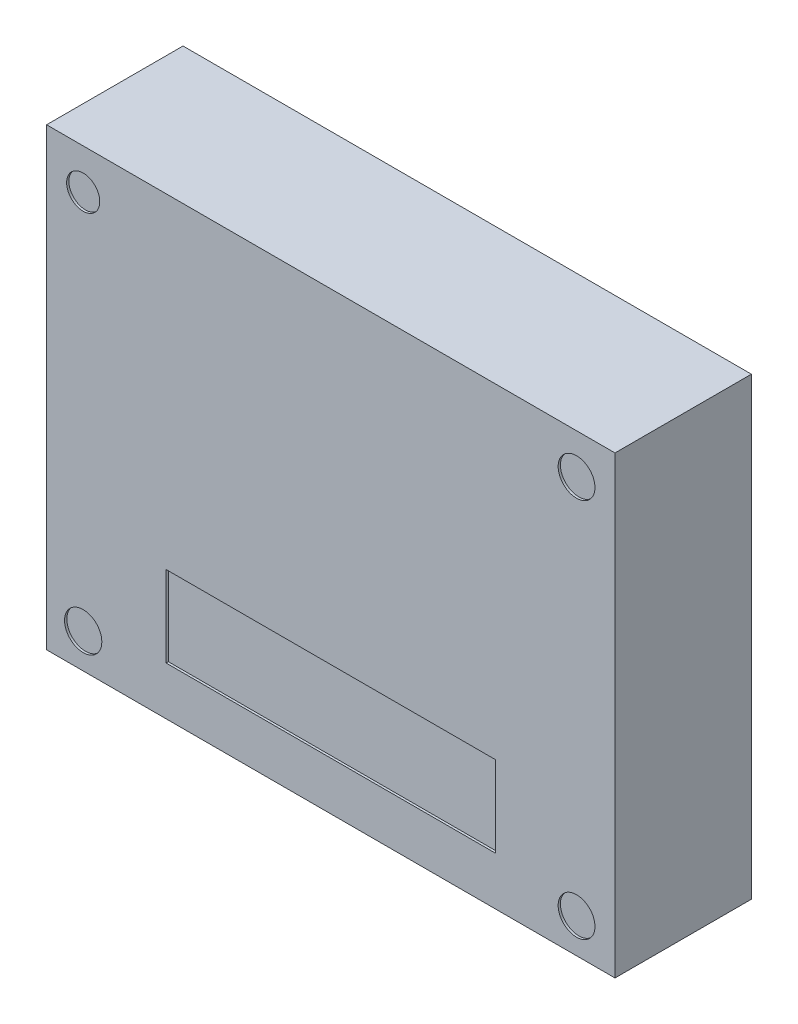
ISO-10303-21;
HEADER;
FILE_DESCRIPTION(('STEP AP214'),'2;1');
FILE_NAME('part.step','',(''),(''),'','','');
FILE_SCHEMA(('AUTOMOTIVE_DESIGN { 1 0 10303 214 1 1 1 1 }'));
ENDSEC;
DATA;
#1=APPLICATION_CONTEXT('core data for automotive mechanical design processes');
#2=APPLICATION_PROTOCOL_DEFINITION('international standard','automotive_design',2000,#1);
#3=PRODUCT_CONTEXT('',#1,'mechanical');
#4=PRODUCT('Part','Part','',(#3));
#5=PRODUCT_RELATED_PRODUCT_CATEGORY('part','',(#4));
#6=PRODUCT_DEFINITION_FORMATION('','',#4);
#7=PRODUCT_DEFINITION_CONTEXT('part definition',#1,'design');
#8=PRODUCT_DEFINITION('design','',#6,#7);
#9=PRODUCT_DEFINITION_SHAPE('','',#8);
#10=(LENGTH_UNIT() NAMED_UNIT(*) SI_UNIT(.MILLI.,.METRE.));
#11=(NAMED_UNIT(*) PLANE_ANGLE_UNIT() SI_UNIT($,.RADIAN.));
#12=(NAMED_UNIT(*) SI_UNIT($,.STERADIAN.) SOLID_ANGLE_UNIT());
#13=UNCERTAINTY_MEASURE_WITH_UNIT(LENGTH_MEASURE(1.E-05),#10,'distance_accuracy_value','');
#14=(GEOMETRIC_REPRESENTATION_CONTEXT(3) GLOBAL_UNCERTAINTY_ASSIGNED_CONTEXT((#13)) GLOBAL_UNIT_ASSIGNED_CONTEXT((#10,
#11,#12)) REPRESENTATION_CONTEXT('',''));
#15=CARTESIAN_POINT('',(0.,0.,0.));
#16=DIRECTION('',(0.,0.,1.));
#17=DIRECTION('',(1.,0.,0.));
#18=AXIS2_PLACEMENT_3D('',#15,#16,#17);
#19=CARTESIAN_POINT('',(-125.,200.,30.));
#20=DIRECTION('',(1.,0.,0.));
#21=DIRECTION('',(0.,0.,-1.));
#22=AXIS2_PLACEMENT_3D('',#19,#20,#21);
#23=PLANE('',#22);
#24=DIRECTION('',(0.,0.,1.));
#25=VECTOR('',#24,1.);
#26=CARTESIAN_POINT('',(-125.,0.,30.));
#27=LINE('',#26,#25);
#28=CARTESIAN_POINT('',(-125.,0.,-30.));
#29=VERTEX_POINT('',#28);
#30=CARTESIAN_POINT('',(-125.,0.,30.));
#31=VERTEX_POINT('',#30);
#32=EDGE_CURVE('E145',#29,#31,#27,.T.);
#33=ORIENTED_EDGE('',*,*,#32,.T.);
#34=DIRECTION('',(0.,-1.,0.));
#35=VECTOR('',#34,1.);
#36=CARTESIAN_POINT('',(-125.,200.,30.));
#37=LINE('',#36,#35);
#38=CARTESIAN_POINT('',(-125.,200.,30.));
#39=VERTEX_POINT('',#38);
#40=EDGE_CURVE('E11',#39,#31,#37,.T.);
#41=ORIENTED_EDGE('',*,*,#40,.F.);
#42=DIRECTION('',(0.,0.,1.));
#43=VECTOR('',#42,1.);
#44=CARTESIAN_POINT('',(-125.,200.,30.));
#45=LINE('',#44,#43);
#46=CARTESIAN_POINT('',(-125.,200.,-30.));
#47=VERTEX_POINT('',#46);
#48=EDGE_CURVE('E149',#47,#39,#45,.T.);
#49=ORIENTED_EDGE('',*,*,#48,.F.);
#50=DIRECTION('',(0.,-1.,0.));
#51=VECTOR('',#50,1.);
#52=CARTESIAN_POINT('',(-125.,200.,-30.));
#53=LINE('',#52,#51);
#54=EDGE_CURVE('E155',#47,#29,#53,.T.);
#55=ORIENTED_EDGE('',*,*,#54,.T.);
#56=EDGE_LOOP('',(#33,#41,#49,#55));
#57=FACE_BOUND('',#56,.T.);
#58=ADVANCED_FACE('F33',(#57),#23,.F.);
#59=CARTESIAN_POINT('',(125.,200.,30.));
#60=DIRECTION('',(0.,0.,-1.));
#61=DIRECTION('',(-1.,0.,0.));
#62=AXIS2_PLACEMENT_3D('',#59,#60,#61);
#63=PLANE('',#62);
#64=CARTESIAN_POINT('',(108.09503550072,182.387040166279,30.));
#65=DIRECTION('',(0.,0.,1.));
#66=DIRECTION('',(1.,0.,0.));
#67=AXIS2_PLACEMENT_3D('',#64,#65,#66);
#68=CIRCLE('',#67,8.09700640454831);
#69=CARTESIAN_POINT('',(116.192041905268,182.387040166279,30.));
#70=VERTEX_POINT('',#69);
#71=EDGE_CURVE('E199',#70,#70,#68,.T.);
#72=ORIENTED_EDGE('',*,*,#71,.F.);
#73=EDGE_LOOP('',(#72));
#74=FACE_BOUND('',#73,.T.);
#75=CARTESIAN_POINT('',(108.09503550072,15.1838579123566,30.));
#76=DIRECTION('',(0.,0.,1.));
#77=DIRECTION('',(1.,0.,0.));
#78=AXIS2_PLACEMENT_3D('',#75,#76,#77);
#79=CIRCLE('',#78,8.09700640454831);
#80=CARTESIAN_POINT('',(116.192041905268,15.1838579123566,30.));
#81=VERTEX_POINT('',#80);
#82=EDGE_CURVE('E203',#81,#81,#79,.T.);
#83=ORIENTED_EDGE('',*,*,#82,.F.);
#84=EDGE_LOOP('',(#83));
#85=FACE_BOUND('',#84,.T.);
#86=CARTESIAN_POINT('',(-108.904736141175,15.1838579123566,30.));
#87=DIRECTION('',(0.,0.,1.));
#88=DIRECTION('',(1.,0.,0.));
#89=AXIS2_PLACEMENT_3D('',#86,#87,#88);
#90=CIRCLE('',#89,8.19759419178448);
#91=CARTESIAN_POINT('',(-100.70714194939,15.1838579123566,30.));
#92=VERTEX_POINT('',#91);
#93=EDGE_CURVE('E207',#92,#92,#90,.T.);
#94=ORIENTED_EDGE('',*,*,#93,.F.);
#95=EDGE_LOOP('',(#94));
#96=FACE_BOUND('',#95,.T.);
#97=CARTESIAN_POINT('',(-108.904736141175,182.387040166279,30.));
#98=DIRECTION('',(0.,0.,1.));
#99=DIRECTION('',(1.,0.,0.));
#100=AXIS2_PLACEMENT_3D('',#97,#98,#99);
#101=CIRCLE('',#100,7.28730576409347);
#102=CARTESIAN_POINT('',(-101.617430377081,182.387040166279,30.));
#103=VERTEX_POINT('',#102);
#104=EDGE_CURVE('E132',#103,#103,#101,.T.);
#105=ORIENTED_EDGE('',*,*,#104,.F.);
#106=EDGE_LOOP('',(#105));
#107=FACE_BOUND('',#106,.T.);
#108=DIRECTION('',(-1.,0.,0.));
#109=VECTOR('',#108,1.);
#110=CARTESIAN_POINT('',(-72.4682073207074,56.8834408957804,30.));
#111=LINE('',#110,#109);
#112=CARTESIAN_POINT('',(72.4682073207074,56.8834408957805,30.));
#113=VERTEX_POINT('',#112);
#114=CARTESIAN_POINT('',(-72.4682073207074,56.8834408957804,30.));
#115=VERTEX_POINT('',#114);
#116=EDGE_CURVE('E138',#113,#115,#111,.T.);
#117=ORIENTED_EDGE('',*,*,#116,.F.);
#118=DIRECTION('',(0.,1.,0.));
#119=VECTOR('',#118,1.);
#120=CARTESIAN_POINT('',(72.4682073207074,56.8834408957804,30.));
#121=LINE('',#120,#119);
#122=CARTESIAN_POINT('',(72.4682073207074,21.2566127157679,30.));
#123=VERTEX_POINT('',#122);
#124=EDGE_CURVE('E47',#123,#113,#121,.T.);
#125=ORIENTED_EDGE('',*,*,#124,.F.);
#126=DIRECTION('',(1.,0.,0.));
#127=VECTOR('',#126,1.);
#128=CARTESIAN_POINT('',(-72.4682073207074,21.2566127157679,30.));
#129=LINE('',#128,#127);
#130=CARTESIAN_POINT('',(-72.4682073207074,21.2566127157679,30.));
#131=VERTEX_POINT('',#130);
#132=EDGE_CURVE('E126',#131,#123,#129,.T.);
#133=ORIENTED_EDGE('',*,*,#132,.F.);
#134=DIRECTION('',(0.,-1.,0.));
#135=VECTOR('',#134,1.);
#136=CARTESIAN_POINT('',(-72.4682073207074,56.8834408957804,30.));
#137=LINE('',#136,#135);
#138=EDGE_CURVE('E129',#115,#131,#137,.T.);
#139=ORIENTED_EDGE('',*,*,#138,.F.);
#140=EDGE_LOOP('',(#117,#125,#133,#139));
#141=FACE_BOUND('',#140,.T.);
#142=DIRECTION('',(1.,0.,0.));
#143=VECTOR('',#142,1.);
#144=CARTESIAN_POINT('',(125.,0.,30.));
#145=LINE('',#144,#143);
#146=CARTESIAN_POINT('',(125.,0.,30.));
#147=VERTEX_POINT('',#146);
#148=EDGE_CURVE('E158',#31,#147,#145,.T.);
#149=ORIENTED_EDGE('',*,*,#148,.T.);
#150=DIRECTION('',(0.,-1.,0.));
#151=VECTOR('',#150,1.);
#152=CARTESIAN_POINT('',(125.,200.,30.));
#153=LINE('',#152,#151);
#154=CARTESIAN_POINT('',(125.,200.,30.));
#155=VERTEX_POINT('',#154);
#156=EDGE_CURVE('E40',#155,#147,#153,.T.);
#157=ORIENTED_EDGE('',*,*,#156,.F.);
#158=DIRECTION('',(1.,0.,0.));
#159=VECTOR('',#158,1.);
#160=CARTESIAN_POINT('',(125.,200.,30.));
#161=LINE('',#160,#159);
#162=EDGE_CURVE('E84',#39,#155,#161,.T.);
#163=ORIENTED_EDGE('',*,*,#162,.F.);
#164=ORIENTED_EDGE('',*,*,#40,.T.);
#165=EDGE_LOOP('',(#149,#157,#163,#164));
#166=FACE_BOUND('',#165,.T.);
#167=ADVANCED_FACE('F186',(#74,#85,#96,#107,#141,#166),#63,.F.);
#168=CARTESIAN_POINT('',(125.,200.,30.));
#169=DIRECTION('',(-1.,0.,0.));
#170=DIRECTION('',(0.,0.,1.));
#171=AXIS2_PLACEMENT_3D('',#168,#169,#170);
#172=PLANE('',#171);
#173=DIRECTION('',(0.,0.,-1.));
#174=VECTOR('',#173,1.);
#175=CARTESIAN_POINT('',(125.,0.,30.));
#176=LINE('',#175,#174);
#177=CARTESIAN_POINT('',(125.,0.,-30.));
#178=VERTEX_POINT('',#177);
#179=EDGE_CURVE('E160',#147,#178,#176,.T.);
#180=ORIENTED_EDGE('',*,*,#179,.T.);
#181=DIRECTION('',(0.,-1.,0.));
#182=VECTOR('',#181,1.);
#183=CARTESIAN_POINT('',(125.,200.,-30.));
#184=LINE('',#183,#182);
#185=CARTESIAN_POINT('',(125.,200.,-30.));
#186=VERTEX_POINT('',#185);
#187=EDGE_CURVE('E164',#186,#178,#184,.T.);
#188=ORIENTED_EDGE('',*,*,#187,.F.);
#189=DIRECTION('',(0.,0.,-1.));
#190=VECTOR('',#189,1.);
#191=CARTESIAN_POINT('',(125.,200.,30.));
#192=LINE('',#191,#190);
#193=EDGE_CURVE('E152',#155,#186,#192,.T.);
#194=ORIENTED_EDGE('',*,*,#193,.F.);
#195=ORIENTED_EDGE('',*,*,#156,.T.);
#196=EDGE_LOOP('',(#180,#188,#194,#195));
#197=FACE_BOUND('',#196,.T.);
#198=ADVANCED_FACE('F169',(#197),#172,.F.);
#199=CARTESIAN_POINT('',(125.,200.,-30.));
#200=DIRECTION('',(0.,0.,1.));
#201=DIRECTION('',(1.,0.,0.));
#202=AXIS2_PLACEMENT_3D('',#199,#200,#201);
#203=PLANE('',#202);
#204=DIRECTION('',(-1.,0.,0.));
#205=VECTOR('',#204,1.);
#206=CARTESIAN_POINT('',(125.,0.,-30.));
#207=LINE('',#206,#205);
#208=EDGE_CURVE('E77',#178,#29,#207,.T.);
#209=ORIENTED_EDGE('',*,*,#208,.T.);
#210=ORIENTED_EDGE('',*,*,#54,.F.);
#211=DIRECTION('',(-1.,0.,0.));
#212=VECTOR('',#211,1.);
#213=CARTESIAN_POINT('',(125.,200.,-30.));
#214=LINE('',#213,#212);
#215=EDGE_CURVE('E56',#186,#47,#214,.T.);
#216=ORIENTED_EDGE('',*,*,#215,.F.);
#217=ORIENTED_EDGE('',*,*,#187,.T.);
#218=EDGE_LOOP('',(#209,#210,#216,#217));
#219=FACE_BOUND('',#218,.T.);
#220=ADVANCED_FACE('F177',(#219),#203,.F.);
#221=CARTESIAN_POINT('',(0.,200.,0.));
#222=DIRECTION('',(0.,1.,0.));
#223=DIRECTION('',(0.,0.,1.));
#224=AXIS2_PLACEMENT_3D('',#221,#222,#223);
#225=PLANE('',#224);
#226=ORIENTED_EDGE('',*,*,#48,.T.);
#227=ORIENTED_EDGE('',*,*,#162,.T.);
#228=ORIENTED_EDGE('',*,*,#193,.T.);
#229=ORIENTED_EDGE('',*,*,#215,.T.);
#230=EDGE_LOOP('',(#226,#227,#228,#229));
#231=FACE_BOUND('',#230,.T.);
#232=ADVANCED_FACE('F179',(#231),#225,.T.);
#233=CARTESIAN_POINT('',(0.,0.,0.));
#234=DIRECTION('',(0.,1.,0.));
#235=DIRECTION('',(0.,0.,1.));
#236=AXIS2_PLACEMENT_3D('',#233,#234,#235);
#237=PLANE('',#236);
#238=ORIENTED_EDGE('',*,*,#32,.F.);
#239=ORIENTED_EDGE('',*,*,#208,.F.);
#240=ORIENTED_EDGE('',*,*,#179,.F.);
#241=ORIENTED_EDGE('',*,*,#148,.F.);
#242=EDGE_LOOP('',(#238,#239,#240,#241));
#243=FACE_BOUND('',#242,.T.);
#244=ADVANCED_FACE('F173',(#243),#237,.F.);
#245=CARTESIAN_POINT('',(72.4682073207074,56.8834408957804,29.));
#246=DIRECTION('',(1.,0.,0.));
#247=DIRECTION('',(0.,0.,-1.));
#248=AXIS2_PLACEMENT_3D('',#245,#246,#247);
#249=PLANE('',#248);
#250=ORIENTED_EDGE('',*,*,#124,.T.);
#251=DIRECTION('',(0.,0.,1.));
#252=VECTOR('',#251,1.);
#253=CARTESIAN_POINT('',(72.4682073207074,56.8834408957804,29.));
#254=LINE('',#253,#252);
#255=CARTESIAN_POINT('',(72.4682073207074,56.8834408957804,29.));
#256=VERTEX_POINT('',#255);
#257=EDGE_CURVE('E104',#256,#113,#254,.T.);
#258=ORIENTED_EDGE('',*,*,#257,.F.);
#259=DIRECTION('',(0.,1.,0.));
#260=VECTOR('',#259,1.);
#261=CARTESIAN_POINT('',(72.4682073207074,56.8834408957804,29.));
#262=LINE('',#261,#260);
#263=CARTESIAN_POINT('',(72.4682073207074,21.2566127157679,29.));
#264=VERTEX_POINT('',#263);
#265=EDGE_CURVE('E108',#264,#256,#262,.T.);
#266=ORIENTED_EDGE('',*,*,#265,.F.);
#267=DIRECTION('',(0.,0.,1.));
#268=VECTOR('',#267,1.);
#269=CARTESIAN_POINT('',(72.4682073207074,21.2566127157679,29.));
#270=LINE('',#269,#268);
#271=EDGE_CURVE('E143',#264,#123,#270,.T.);
#272=ORIENTED_EDGE('',*,*,#271,.T.);
#273=EDGE_LOOP('',(#250,#258,#266,#272));
#274=FACE_BOUND('',#273,.T.);
#275=ADVANCED_FACE('F106',(#274),#249,.F.);
#276=CARTESIAN_POINT('',(-72.4682073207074,21.2566127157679,29.));
#277=DIRECTION('',(0.,-1.,0.));
#278=DIRECTION('',(0.,0.,-1.));
#279=AXIS2_PLACEMENT_3D('',#276,#277,#278);
#280=PLANE('',#279);
#281=ORIENTED_EDGE('',*,*,#132,.T.);
#282=ORIENTED_EDGE('',*,*,#271,.F.);
#283=DIRECTION('',(1.,0.,0.));
#284=VECTOR('',#283,1.);
#285=CARTESIAN_POINT('',(-72.4682073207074,21.2566127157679,29.));
#286=LINE('',#285,#284);
#287=CARTESIAN_POINT('',(-72.4682073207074,21.2566127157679,29.));
#288=VERTEX_POINT('',#287);
#289=EDGE_CURVE('E114',#288,#264,#286,.T.);
#290=ORIENTED_EDGE('',*,*,#289,.F.);
#291=DIRECTION('',(0.,0.,1.));
#292=VECTOR('',#291,1.);
#293=CARTESIAN_POINT('',(-72.4682073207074,21.2566127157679,29.));
#294=LINE('',#293,#292);
#295=EDGE_CURVE('E146',#288,#131,#294,.T.);
#296=ORIENTED_EDGE('',*,*,#295,.T.);
#297=EDGE_LOOP('',(#281,#282,#290,#296));
#298=FACE_BOUND('',#297,.T.);
#299=ADVANCED_FACE('F216',(#298),#280,.F.);
#300=CARTESIAN_POINT('',(-72.4682073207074,56.8834408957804,29.));
#301=DIRECTION('',(-1.,0.,0.));
#302=DIRECTION('',(0.,0.,1.));
#303=AXIS2_PLACEMENT_3D('',#300,#301,#302);
#304=PLANE('',#303);
#305=ORIENTED_EDGE('',*,*,#138,.T.);
#306=ORIENTED_EDGE('',*,*,#295,.F.);
#307=DIRECTION('',(0.,-1.,0.));
#308=VECTOR('',#307,1.);
#309=CARTESIAN_POINT('',(-72.4682073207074,56.8834408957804,29.));
#310=LINE('',#309,#308);
#311=CARTESIAN_POINT('',(-72.4682073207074,56.8834408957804,29.));
#312=VERTEX_POINT('',#311);
#313=EDGE_CURVE('E122',#312,#288,#310,.T.);
#314=ORIENTED_EDGE('',*,*,#313,.F.);
#315=DIRECTION('',(0.,0.,1.));
#316=VECTOR('',#315,1.);
#317=CARTESIAN_POINT('',(-72.4682073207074,56.8834408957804,29.));
#318=LINE('',#317,#316);
#319=EDGE_CURVE('E113',#312,#115,#318,.T.);
#320=ORIENTED_EDGE('',*,*,#319,.T.);
#321=EDGE_LOOP('',(#305,#306,#314,#320));
#322=FACE_BOUND('',#321,.T.);
#323=ADVANCED_FACE('F214',(#322),#304,.F.);
#324=CARTESIAN_POINT('',(-72.4682073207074,56.8834408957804,29.));
#325=DIRECTION('',(0.,1.,0.));
#326=DIRECTION('',(0.,0.,1.));
#327=AXIS2_PLACEMENT_3D('',#324,#325,#326);
#328=PLANE('',#327);
#329=ORIENTED_EDGE('',*,*,#116,.T.);
#330=ORIENTED_EDGE('',*,*,#319,.F.);
#331=DIRECTION('',(-1.,0.,0.));
#332=VECTOR('',#331,1.);
#333=CARTESIAN_POINT('',(-72.4682073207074,56.8834408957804,29.));
#334=LINE('',#333,#332);
#335=EDGE_CURVE('E117',#256,#312,#334,.T.);
#336=ORIENTED_EDGE('',*,*,#335,.F.);
#337=ORIENTED_EDGE('',*,*,#257,.T.);
#338=EDGE_LOOP('',(#329,#330,#336,#337));
#339=FACE_BOUND('',#338,.T.);
#340=ADVANCED_FACE('F118',(#339),#328,.F.);
#341=CARTESIAN_POINT('',(0.,0.,29.));
#342=DIRECTION('',(0.,0.,1.));
#343=DIRECTION('',(1.,0.,0.));
#344=AXIS2_PLACEMENT_3D('',#341,#342,#343);
#345=PLANE('',#344);
#346=ORIENTED_EDGE('',*,*,#265,.T.);
#347=ORIENTED_EDGE('',*,*,#335,.T.);
#348=ORIENTED_EDGE('',*,*,#313,.T.);
#349=ORIENTED_EDGE('',*,*,#289,.T.);
#350=EDGE_LOOP('',(#346,#347,#348,#349));
#351=FACE_BOUND('',#350,.T.);
#352=ADVANCED_FACE('F124',(#351),#345,.T.);
#353=CARTESIAN_POINT('',(-108.904736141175,182.387040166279,29.));
#354=DIRECTION('',(0.,0.,1.));
#355=DIRECTION('',(1.,0.,0.));
#356=AXIS2_PLACEMENT_3D('',#353,#354,#355);
#357=CYLINDRICAL_SURFACE('',#356,7.28730576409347);
#358=CARTESIAN_POINT('',(-108.904736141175,182.387040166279,29.));
#359=DIRECTION('',(0.,0.,1.));
#360=DIRECTION('',(1.,0.,0.));
#361=AXIS2_PLACEMENT_3D('',#358,#359,#360);
#362=CIRCLE('',#361,7.28730576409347);
#363=CARTESIAN_POINT('',(-101.617430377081,182.387040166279,29.));
#364=VERTEX_POINT('',#363);
#365=EDGE_CURVE('E139',#364,#364,#362,.T.);
#366=ORIENTED_EDGE('',*,*,#365,.F.);
#367=EDGE_LOOP('',(#366));
#368=FACE_BOUND('',#367,.T.);
#369=ORIENTED_EDGE('',*,*,#104,.T.);
#370=EDGE_LOOP('',(#369));
#371=FACE_BOUND('',#370,.T.);
#372=ADVANCED_FACE('F262',(#368,#371),#357,.F.);
#373=CARTESIAN_POINT('',(-108.904736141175,182.387040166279,29.));
#374=DIRECTION('',(0.,0.,1.));
#375=DIRECTION('',(1.,0.,0.));
#376=AXIS2_PLACEMENT_3D('',#373,#374,#375);
#377=PLANE('',#376);
#378=ORIENTED_EDGE('',*,*,#365,.T.);
#379=EDGE_LOOP('',(#378));
#380=FACE_BOUND('',#379,.T.);
#381=ADVANCED_FACE('F277',(#380),#377,.T.);
#382=CARTESIAN_POINT('',(-108.904736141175,15.1838579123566,29.));
#383=DIRECTION('',(0.,0.,1.));
#384=DIRECTION('',(1.,0.,0.));
#385=AXIS2_PLACEMENT_3D('',#382,#383,#384);
#386=CYLINDRICAL_SURFACE('',#385,8.19759419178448);
#387=CARTESIAN_POINT('',(-108.904736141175,15.1838579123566,29.));
#388=DIRECTION('',(0.,0.,1.));
#389=DIRECTION('',(1.,0.,0.));
#390=AXIS2_PLACEMENT_3D('',#387,#388,#389);
#391=CIRCLE('',#390,8.19759419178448);
#392=CARTESIAN_POINT('',(-100.70714194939,15.1838579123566,29.));
#393=VERTEX_POINT('',#392);
#394=EDGE_CURVE('E360',#393,#393,#391,.T.);
#395=ORIENTED_EDGE('',*,*,#394,.F.);
#396=EDGE_LOOP('',(#395));
#397=FACE_BOUND('',#396,.T.);
#398=ORIENTED_EDGE('',*,*,#93,.T.);
#399=EDGE_LOOP('',(#398));
#400=FACE_BOUND('',#399,.T.);
#401=ADVANCED_FACE('F286',(#397,#400),#386,.F.);
#402=CARTESIAN_POINT('',(-108.904736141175,15.1838579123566,29.));
#403=DIRECTION('',(0.,0.,1.));
#404=DIRECTION('',(1.,0.,0.));
#405=AXIS2_PLACEMENT_3D('',#402,#403,#404);
#406=PLANE('',#405);
#407=ORIENTED_EDGE('',*,*,#394,.T.);
#408=EDGE_LOOP('',(#407));
#409=FACE_BOUND('',#408,.T.);
#410=ADVANCED_FACE('F296',(#409),#406,.T.);
#411=CARTESIAN_POINT('',(108.09503550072,15.1838579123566,29.));
#412=DIRECTION('',(0.,0.,1.));
#413=DIRECTION('',(1.,0.,0.));
#414=AXIS2_PLACEMENT_3D('',#411,#412,#413);
#415=CYLINDRICAL_SURFACE('',#414,8.09700640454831);
#416=CARTESIAN_POINT('',(108.09503550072,15.1838579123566,29.));
#417=DIRECTION('',(0.,0.,1.));
#418=DIRECTION('',(1.,0.,0.));
#419=AXIS2_PLACEMENT_3D('',#416,#417,#418);
#420=CIRCLE('',#419,8.09700640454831);
#421=CARTESIAN_POINT('',(116.192041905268,15.1838579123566,29.));
#422=VERTEX_POINT('',#421);
#423=EDGE_CURVE('E354',#422,#422,#420,.T.);
#424=ORIENTED_EDGE('',*,*,#423,.F.);
#425=EDGE_LOOP('',(#424));
#426=FACE_BOUND('',#425,.T.);
#427=ORIENTED_EDGE('',*,*,#82,.T.);
#428=EDGE_LOOP('',(#427));
#429=FACE_BOUND('',#428,.T.);
#430=ADVANCED_FACE('F306',(#426,#429),#415,.F.);
#431=CARTESIAN_POINT('',(108.09503550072,15.1838579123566,29.));
#432=DIRECTION('',(0.,0.,1.));
#433=DIRECTION('',(1.,0.,0.));
#434=AXIS2_PLACEMENT_3D('',#431,#432,#433);
#435=PLANE('',#434);
#436=ORIENTED_EDGE('',*,*,#423,.T.);
#437=EDGE_LOOP('',(#436));
#438=FACE_BOUND('',#437,.T.);
#439=ADVANCED_FACE('F316',(#438),#435,.T.);
#440=CARTESIAN_POINT('',(108.09503550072,182.387040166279,29.));
#441=DIRECTION('',(0.,0.,1.));
#442=DIRECTION('',(1.,0.,0.));
#443=AXIS2_PLACEMENT_3D('',#440,#441,#442);
#444=CYLINDRICAL_SURFACE('',#443,8.09700640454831);
#445=CARTESIAN_POINT('',(108.09503550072,182.387040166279,29.));
#446=DIRECTION('',(0.,0.,1.));
#447=DIRECTION('',(1.,0.,0.));
#448=AXIS2_PLACEMENT_3D('',#445,#446,#447);
#449=CIRCLE('',#448,8.09700640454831);
#450=CARTESIAN_POINT('',(116.192041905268,182.387040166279,29.));
#451=VERTEX_POINT('',#450);
#452=EDGE_CURVE('E352',#451,#451,#449,.T.);
#453=ORIENTED_EDGE('',*,*,#452,.F.);
#454=EDGE_LOOP('',(#453));
#455=FACE_BOUND('',#454,.T.);
#456=ORIENTED_EDGE('',*,*,#71,.T.);
#457=EDGE_LOOP('',(#456));
#458=FACE_BOUND('',#457,.T.);
#459=ADVANCED_FACE('F326',(#455,#458),#444,.F.);
#460=CARTESIAN_POINT('',(108.09503550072,182.387040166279,29.));
#461=DIRECTION('',(0.,0.,1.));
#462=DIRECTION('',(1.,0.,0.));
#463=AXIS2_PLACEMENT_3D('',#460,#461,#462);
#464=PLANE('',#463);
#465=ORIENTED_EDGE('',*,*,#452,.T.);
#466=EDGE_LOOP('',(#465));
#467=FACE_BOUND('',#466,.T.);
#468=ADVANCED_FACE('F336',(#467),#464,.T.);
#469=CLOSED_SHELL('',(#58,#167,#198,#220,#232,#244,#275,#299,#323,#340,#352,#372,#381,#401,#410,
#430,#439,#459,#468));
#470=MANIFOLD_SOLID_BREP('B2',#469);
#471=ADVANCED_BREP_SHAPE_REPRESENTATION('',(#18,#470),#14);
#472=SHAPE_DEFINITION_REPRESENTATION(#9,#471);
ENDSEC;
END-ISO-10303-21;
